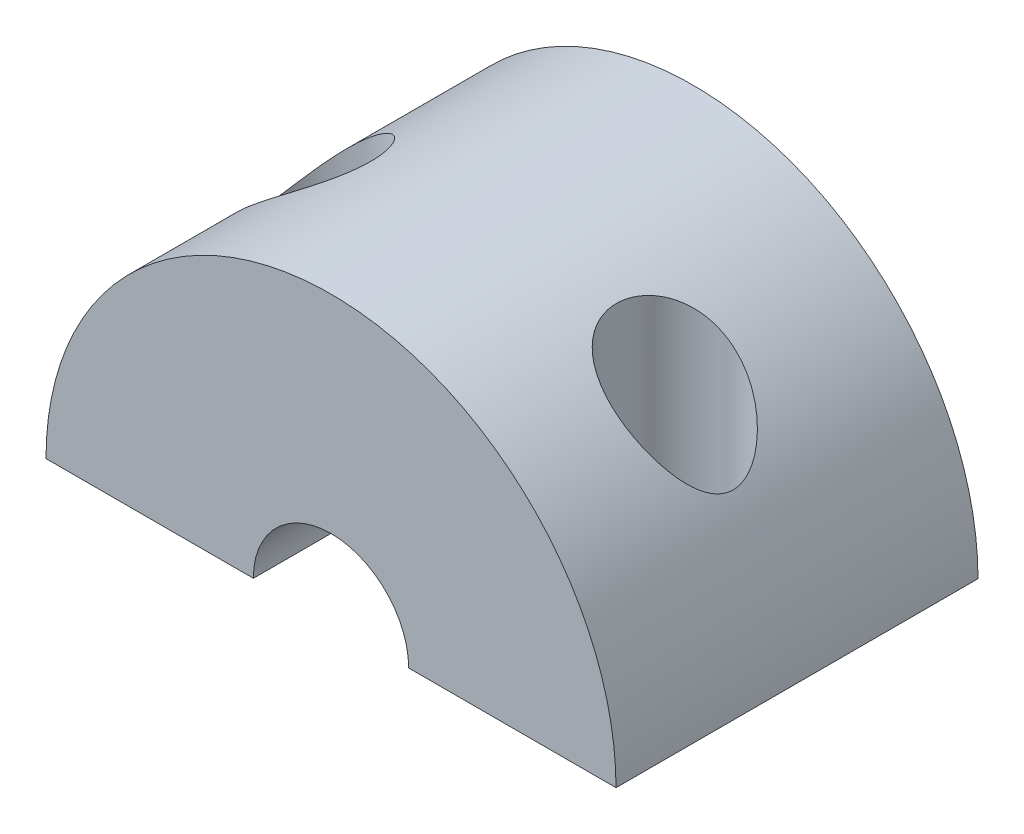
from build123d import *

# Parameters (mm, degrees)
BOSS_EXTRUDE1_DEPTH = 12.7
SKETCH2_R           = 2.05
CUT_EXTRUDE1_DEPTH  = 20.007630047


with BuildPart() as part:
    # Sketch1 → Boss-Extrude1 (new body)
    with BuildSketch(Plane.XY):
        with BuildLine():
            Line((-10, 0), (-2.725, 0))
            ThreePointArc((-2.725, 0), (0, 2.725), (2.725, 0))
            Line((2.725, 0), (10, 0))
            ThreePointArc((10, 0), (0, 10), (-10, 0))
        make_face()
    extrude(amount=BOSS_EXTRUDE1_DEPTH)

    # Sketch2 → Cut-Extrude1 (cut, through all)
    with BuildSketch(Plane.XZ):
        with Locations(Location((-6.3625, 7, 0), (0, 0, 270))):
            Circle(SKETCH2_R)
        with Locations(Location((6.3625, 7, 0), (0, 0, 270))):
            Circle(SKETCH2_R)
    extrude(amount=-CUT_EXTRUDE1_DEPTH, mode=Mode.SUBTRACT)


solid = part.part
